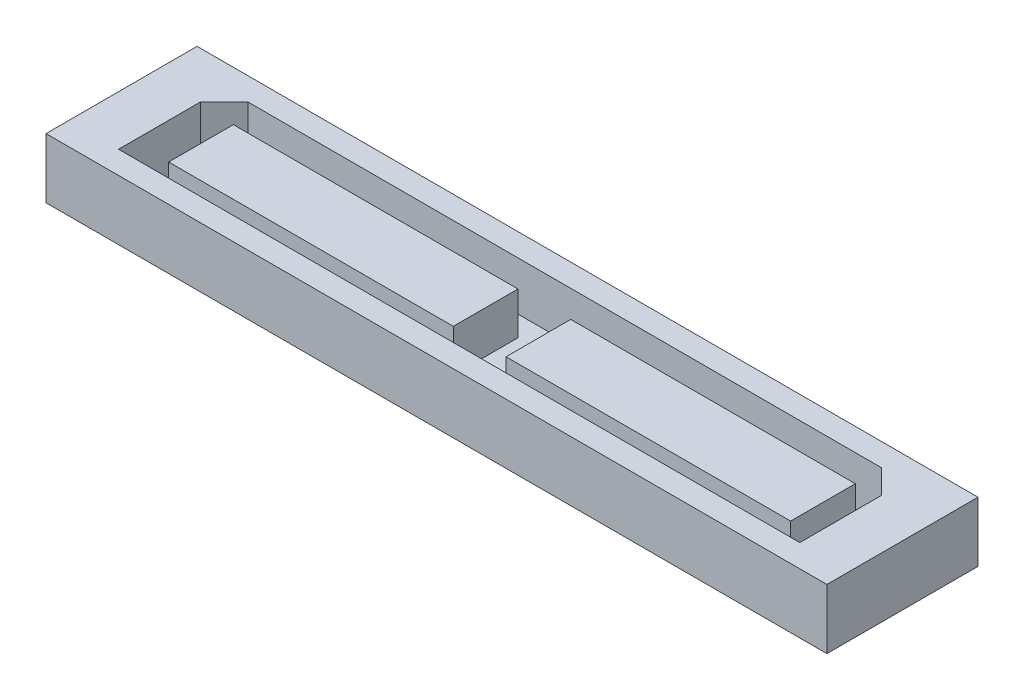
ISO-10303-21;
HEADER;
FILE_DESCRIPTION(('STEP AP214'),'2;1');
FILE_NAME('part.step','',(''),(''),'','','');
FILE_SCHEMA(('AUTOMOTIVE_DESIGN { 1 0 10303 214 1 1 1 1 }'));
ENDSEC;
DATA;
#1=APPLICATION_CONTEXT('core data for automotive mechanical design processes');
#2=APPLICATION_PROTOCOL_DEFINITION('international standard','automotive_design',2000,#1);
#3=PRODUCT_CONTEXT('',#1,'mechanical');
#4=PRODUCT('Part','Part','',(#3));
#5=PRODUCT_RELATED_PRODUCT_CATEGORY('part','',(#4));
#6=PRODUCT_DEFINITION_FORMATION('','',#4);
#7=PRODUCT_DEFINITION_CONTEXT('part definition',#1,'design');
#8=PRODUCT_DEFINITION('design','',#6,#7);
#9=PRODUCT_DEFINITION_SHAPE('','',#8);
#10=(LENGTH_UNIT() NAMED_UNIT(*) SI_UNIT(.MILLI.,.METRE.));
#11=(NAMED_UNIT(*) PLANE_ANGLE_UNIT() SI_UNIT($,.RADIAN.));
#12=(NAMED_UNIT(*) SI_UNIT($,.STERADIAN.) SOLID_ANGLE_UNIT());
#13=UNCERTAINTY_MEASURE_WITH_UNIT(LENGTH_MEASURE(1.E-05),#10,'distance_accuracy_value','');
#14=(GEOMETRIC_REPRESENTATION_CONTEXT(3) GLOBAL_UNCERTAINTY_ASSIGNED_CONTEXT((#13)) GLOBAL_UNIT_ASSIGNED_CONTEXT((#10,
#11,#12)) REPRESENTATION_CONTEXT('',''));
#15=CARTESIAN_POINT('',(0.,0.,0.));
#16=DIRECTION('',(0.,0.,1.));
#17=DIRECTION('',(1.,0.,0.));
#18=AXIS2_PLACEMENT_3D('',#15,#16,#17);
#19=CARTESIAN_POINT('',(-20.065365,0.761999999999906,-3.1115));
#20=DIRECTION('',(0.,-1.,0.));
#21=DIRECTION('',(0.,0.,-1.));
#22=AXIS2_PLACEMENT_3D('',#19,#20,#21);
#23=PLANE('',#22);
#24=DIRECTION('',(0.,0.,1.));
#25=VECTOR('',#24,1.);
#26=CARTESIAN_POINT('',(1.55321000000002,0.761999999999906,1.90499999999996));
#27=LINE('',#26,#25);
#28=CARTESIAN_POINT('',(1.55321000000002,0.761999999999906,-1.90500000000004));
#29=VERTEX_POINT('',#28);
#30=CARTESIAN_POINT('',(1.55321000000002,0.761999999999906,1.90499999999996));
#31=VERTEX_POINT('',#30);
#32=EDGE_CURVE('E191',#29,#31,#27,.T.);
#33=ORIENTED_EDGE('',*,*,#32,.F.);
#34=DIRECTION('',(-1.,0.,0.));
#35=VECTOR('',#34,1.);
#36=CARTESIAN_POINT('',(1.55321000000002,0.761999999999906,-1.90500000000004));
#37=LINE('',#36,#35);
#38=CARTESIAN_POINT('',(18.31721,0.761999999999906,-1.90500000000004));
#39=VERTEX_POINT('',#38);
#40=EDGE_CURVE('E200',#39,#29,#37,.T.);
#41=ORIENTED_EDGE('',*,*,#40,.F.);
#42=DIRECTION('',(0.,0.,-1.));
#43=VECTOR('',#42,1.);
#44=CARTESIAN_POINT('',(18.31721,0.761999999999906,-1.90500000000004));
#45=LINE('',#44,#43);
#46=CARTESIAN_POINT('',(18.31721,0.761999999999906,1.90499999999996));
#47=VERTEX_POINT('',#46);
#48=EDGE_CURVE('E197',#47,#39,#45,.T.);
#49=ORIENTED_EDGE('',*,*,#48,.F.);
#50=DIRECTION('',(1.,0.,0.));
#51=VECTOR('',#50,1.);
#52=CARTESIAN_POINT('',(18.31721,0.761999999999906,1.90499999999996));
#53=LINE('',#52,#51);
#54=EDGE_CURVE('E194',#31,#47,#53,.T.);
#55=ORIENTED_EDGE('',*,*,#54,.F.);
#56=EDGE_LOOP('',(#33,#41,#49,#55));
#57=FACE_BOUND('',#56,.T.);
#58=DIRECTION('',(-1.,0.,0.));
#59=VECTOR('',#58,1.);
#60=CARTESIAN_POINT('',(20.065365,0.761999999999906,-3.11150000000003));
#61=LINE('',#60,#59);
#62=CARTESIAN_POINT('',(18.668365,0.761999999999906,-3.11150000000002));
#63=VERTEX_POINT('',#62);
#64=CARTESIAN_POINT('',(-18.668365,0.761999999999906,-3.1115));
#65=VERTEX_POINT('',#64);
#66=EDGE_CURVE('E241',#63,#65,#61,.T.);
#67=ORIENTED_EDGE('',*,*,#66,.T.);
#68=DIRECTION('',(0.707106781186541,0.,-0.707106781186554));
#69=VECTOR('',#68,1.);
#70=CARTESIAN_POINT('',(-20.065365,0.761999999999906,-1.71449999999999));
#71=LINE('',#70,#69);
#72=CARTESIAN_POINT('',(-20.065365,0.761999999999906,-1.71449999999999));
#73=VERTEX_POINT('',#72);
#74=EDGE_CURVE('E291',#65,#73,#71,.F.);
#75=ORIENTED_EDGE('',*,*,#74,.T.);
#76=DIRECTION('',(0.,0.,1.));
#77=VECTOR('',#76,1.);
#78=CARTESIAN_POINT('',(-20.065365,0.761999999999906,-3.1115));
#79=LINE('',#78,#77);
#80=CARTESIAN_POINT('',(-20.065365,0.761999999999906,3.11149999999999));
#81=VERTEX_POINT('',#80);
#82=EDGE_CURVE('E234',#73,#81,#79,.T.);
#83=ORIENTED_EDGE('',*,*,#82,.T.);
#84=DIRECTION('',(1.,0.,0.));
#85=VECTOR('',#84,1.);
#86=CARTESIAN_POINT('',(-20.065365,0.761999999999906,3.11149999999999));
#87=LINE('',#86,#85);
#88=CARTESIAN_POINT('',(20.065365,0.761999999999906,3.11149999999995));
#89=VERTEX_POINT('',#88);
#90=EDGE_CURVE('E236',#81,#89,#87,.T.);
#91=ORIENTED_EDGE('',*,*,#90,.T.);
#92=DIRECTION('',(0.,0.,-1.));
#93=VECTOR('',#92,1.);
#94=CARTESIAN_POINT('',(20.065365,0.761999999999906,3.11149999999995));
#95=LINE('',#94,#93);
#96=CARTESIAN_POINT('',(20.065365,0.761999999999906,-1.71450000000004));
#97=VERTEX_POINT('',#96);
#98=EDGE_CURVE('E239',#89,#97,#95,.T.);
#99=ORIENTED_EDGE('',*,*,#98,.T.);
#100=DIRECTION('',(0.707106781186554,0.,0.707106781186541));
#101=VECTOR('',#100,1.);
#102=CARTESIAN_POINT('',(18.668365,0.761999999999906,-3.11150000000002));
#103=LINE('',#102,#101);
#104=EDGE_CURVE('E289',#97,#63,#103,.F.);
#105=ORIENTED_EDGE('',*,*,#104,.T.);
#106=EDGE_LOOP('',(#67,#75,#83,#91,#99,#105));
#107=FACE_BOUND('',#106,.T.);
#108=DIRECTION('',(1.,0.,0.));
#109=VECTOR('',#108,1.);
#110=CARTESIAN_POINT('',(-18.31721,0.761999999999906,1.90499999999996));
#111=LINE('',#110,#109);
#112=CARTESIAN_POINT('',(-18.31721,0.761999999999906,1.90499999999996));
#113=VERTEX_POINT('',#112);
#114=CARTESIAN_POINT('',(-1.55321000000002,0.761999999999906,1.90499999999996));
#115=VERTEX_POINT('',#114);
#116=EDGE_CURVE('E154',#113,#115,#111,.T.);
#117=ORIENTED_EDGE('',*,*,#116,.F.);
#118=DIRECTION('',(0.,0.,1.));
#119=VECTOR('',#118,1.);
#120=CARTESIAN_POINT('',(-18.31721,0.761999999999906,-1.90500000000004));
#121=LINE('',#120,#119);
#122=CARTESIAN_POINT('',(-18.31721,0.761999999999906,-1.90500000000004));
#123=VERTEX_POINT('',#122);
#124=EDGE_CURVE('E156',#123,#113,#121,.T.);
#125=ORIENTED_EDGE('',*,*,#124,.F.);
#126=DIRECTION('',(-1.,0.,0.));
#127=VECTOR('',#126,1.);
#128=CARTESIAN_POINT('',(-1.55321000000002,0.761999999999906,-1.90500000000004));
#129=LINE('',#128,#127);
#130=CARTESIAN_POINT('',(-1.55321000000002,0.761999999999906,-1.90500000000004));
#131=VERTEX_POINT('',#130);
#132=EDGE_CURVE('E175',#131,#123,#129,.T.);
#133=ORIENTED_EDGE('',*,*,#132,.F.);
#134=DIRECTION('',(0.,0.,-1.));
#135=VECTOR('',#134,1.);
#136=CARTESIAN_POINT('',(-1.55321000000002,0.761999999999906,1.90499999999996));
#137=LINE('',#136,#135);
#138=EDGE_CURVE('E159',#115,#131,#137,.T.);
#139=ORIENTED_EDGE('',*,*,#138,.F.);
#140=EDGE_LOOP('',(#117,#125,#133,#139));
#141=FACE_BOUND('',#140,.T.);
#142=ADVANCED_FACE('F30',(#57,#107,#141),#23,.F.);
#143=CARTESIAN_POINT('',(23.,0.101599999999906,4.45));
#144=DIRECTION('',(1.,0.,0.));
#145=DIRECTION('',(0.,0.,-1.));
#146=AXIS2_PLACEMENT_3D('',#143,#144,#145);
#147=PLANE('',#146);
#148=DIRECTION('',(0.,0.,-1.));
#149=VECTOR('',#148,1.);
#150=CARTESIAN_POINT('',(23.,3.63219999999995,4.45));
#151=LINE('',#150,#149);
#152=CARTESIAN_POINT('',(23.,3.63219999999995,4.45));
#153=VERTEX_POINT('',#152);
#154=CARTESIAN_POINT('',(23.,3.63219999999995,-4.45));
#155=VERTEX_POINT('',#154);
#156=EDGE_CURVE('E247',#153,#155,#151,.T.);
#157=ORIENTED_EDGE('',*,*,#156,.F.);
#158=DIRECTION('',(0.,1.,0.));
#159=VECTOR('',#158,1.);
#160=CARTESIAN_POINT('',(23.,0.101599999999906,4.45));
#161=LINE('',#160,#159);
#162=CARTESIAN_POINT('',(23.,0.101599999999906,4.45));
#163=VERTEX_POINT('',#162);
#164=EDGE_CURVE('E274',#163,#153,#161,.T.);
#165=ORIENTED_EDGE('',*,*,#164,.F.);
#166=DIRECTION('',(0.,0.,-1.));
#167=VECTOR('',#166,1.);
#168=CARTESIAN_POINT('',(23.,0.101599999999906,4.45));
#169=LINE('',#168,#167);
#170=CARTESIAN_POINT('',(23.,0.101599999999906,-4.45));
#171=VERTEX_POINT('',#170);
#172=EDGE_CURVE('E261',#163,#171,#169,.T.);
#173=ORIENTED_EDGE('',*,*,#172,.T.);
#174=DIRECTION('',(0.,1.,0.));
#175=VECTOR('',#174,1.);
#176=CARTESIAN_POINT('',(23.,0.101599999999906,-4.45));
#177=LINE('',#176,#175);
#178=EDGE_CURVE('E273',#171,#155,#177,.T.);
#179=ORIENTED_EDGE('',*,*,#178,.T.);
#180=EDGE_LOOP('',(#157,#165,#173,#179));
#181=FACE_BOUND('',#180,.T.);
#182=ADVANCED_FACE('F32',(#181),#147,.T.);
#183=CARTESIAN_POINT('',(-23.,0.101599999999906,4.45));
#184=DIRECTION('',(0.,0.,1.));
#185=DIRECTION('',(1.,0.,0.));
#186=AXIS2_PLACEMENT_3D('',#183,#184,#185);
#187=PLANE('',#186);
#188=DIRECTION('',(1.,0.,0.));
#189=VECTOR('',#188,1.);
#190=CARTESIAN_POINT('',(-23.,3.63219999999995,4.45));
#191=LINE('',#190,#189);
#192=CARTESIAN_POINT('',(-23.,3.63219999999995,4.45));
#193=VERTEX_POINT('',#192);
#194=EDGE_CURVE('E258',#193,#153,#191,.T.);
#195=ORIENTED_EDGE('',*,*,#194,.F.);
#196=DIRECTION('',(0.,1.,0.));
#197=VECTOR('',#196,1.);
#198=CARTESIAN_POINT('',(-23.,0.101599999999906,4.45));
#199=LINE('',#198,#197);
#200=CARTESIAN_POINT('',(-23.,0.101599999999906,4.45));
#201=VERTEX_POINT('',#200);
#202=EDGE_CURVE('E277',#201,#193,#199,.T.);
#203=ORIENTED_EDGE('',*,*,#202,.F.);
#204=DIRECTION('',(1.,0.,0.));
#205=VECTOR('',#204,1.);
#206=CARTESIAN_POINT('',(-23.,0.101599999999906,4.45));
#207=LINE('',#206,#205);
#208=EDGE_CURVE('E270',#201,#163,#207,.T.);
#209=ORIENTED_EDGE('',*,*,#208,.T.);
#210=ORIENTED_EDGE('',*,*,#164,.T.);
#211=EDGE_LOOP('',(#195,#203,#209,#210));
#212=FACE_BOUND('',#211,.T.);
#213=ADVANCED_FACE('F330',(#212),#187,.T.);
#214=CARTESIAN_POINT('',(-23.,0.101599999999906,-4.45));
#215=DIRECTION('',(-1.,0.,0.));
#216=DIRECTION('',(0.,0.,1.));
#217=AXIS2_PLACEMENT_3D('',#214,#215,#216);
#218=PLANE('',#217);
#219=DIRECTION('',(0.,0.,1.));
#220=VECTOR('',#219,1.);
#221=CARTESIAN_POINT('',(-23.,3.63219999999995,-4.45));
#222=LINE('',#221,#220);
#223=CARTESIAN_POINT('',(-23.,3.63219999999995,-4.45));
#224=VERTEX_POINT('',#223);
#225=EDGE_CURVE('E255',#224,#193,#222,.T.);
#226=ORIENTED_EDGE('',*,*,#225,.F.);
#227=DIRECTION('',(0.,1.,0.));
#228=VECTOR('',#227,1.);
#229=CARTESIAN_POINT('',(-23.,0.101599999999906,-4.45));
#230=LINE('',#229,#228);
#231=CARTESIAN_POINT('',(-23.,0.101599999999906,-4.45));
#232=VERTEX_POINT('',#231);
#233=EDGE_CURVE('E279',#232,#224,#230,.T.);
#234=ORIENTED_EDGE('',*,*,#233,.F.);
#235=DIRECTION('',(0.,0.,1.));
#236=VECTOR('',#235,1.);
#237=CARTESIAN_POINT('',(-23.,0.101599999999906,-4.45));
#238=LINE('',#237,#236);
#239=EDGE_CURVE('E267',#232,#201,#238,.T.);
#240=ORIENTED_EDGE('',*,*,#239,.T.);
#241=ORIENTED_EDGE('',*,*,#202,.T.);
#242=EDGE_LOOP('',(#226,#234,#240,#241));
#243=FACE_BOUND('',#242,.T.);
#244=ADVANCED_FACE('F354',(#243),#218,.T.);
#245=CARTESIAN_POINT('',(23.,0.101599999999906,-4.45));
#246=DIRECTION('',(0.,0.,-1.));
#247=DIRECTION('',(-1.,0.,0.));
#248=AXIS2_PLACEMENT_3D('',#245,#246,#247);
#249=PLANE('',#248);
#250=DIRECTION('',(-1.,0.,0.));
#251=VECTOR('',#250,1.);
#252=CARTESIAN_POINT('',(23.,3.63219999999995,-4.45));
#253=LINE('',#252,#251);
#254=EDGE_CURVE('E252',#155,#224,#253,.T.);
#255=ORIENTED_EDGE('',*,*,#254,.F.);
#256=ORIENTED_EDGE('',*,*,#178,.F.);
#257=DIRECTION('',(-1.,0.,0.));
#258=VECTOR('',#257,1.);
#259=CARTESIAN_POINT('',(23.,0.101599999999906,-4.45));
#260=LINE('',#259,#258);
#261=EDGE_CURVE('E264',#171,#232,#260,.T.);
#262=ORIENTED_EDGE('',*,*,#261,.T.);
#263=ORIENTED_EDGE('',*,*,#233,.T.);
#264=EDGE_LOOP('',(#255,#256,#262,#263));
#265=FACE_BOUND('',#264,.T.);
#266=ADVANCED_FACE('F350',(#265),#249,.T.);
#267=CARTESIAN_POINT('',(23.,0.101599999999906,-4.45));
#268=DIRECTION('',(0.,1.,0.));
#269=DIRECTION('',(0.,0.,1.));
#270=AXIS2_PLACEMENT_3D('',#267,#268,#269);
#271=PLANE('',#270);
#272=ORIENTED_EDGE('',*,*,#172,.F.);
#273=ORIENTED_EDGE('',*,*,#208,.F.);
#274=ORIENTED_EDGE('',*,*,#239,.F.);
#275=ORIENTED_EDGE('',*,*,#261,.F.);
#276=EDGE_LOOP('',(#272,#273,#274,#275));
#277=FACE_BOUND('',#276,.T.);
#278=ADVANCED_FACE('F347',(#277),#271,.F.);
#279=CARTESIAN_POINT('',(23.,3.63219999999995,-4.45));
#280=DIRECTION('',(0.,1.,0.));
#281=DIRECTION('',(0.,0.,1.));
#282=AXIS2_PLACEMENT_3D('',#279,#280,#281);
#283=PLANE('',#282);
#284=DIRECTION('',(0.,0.,1.));
#285=VECTOR('',#284,1.);
#286=CARTESIAN_POINT('',(-20.065365,3.63219999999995,-3.1115));
#287=LINE('',#286,#285);
#288=CARTESIAN_POINT('',(-20.065365,3.63219999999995,-1.71449999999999));
#289=VERTEX_POINT('',#288);
#290=CARTESIAN_POINT('',(-20.065365,3.63219999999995,3.11149999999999));
#291=VERTEX_POINT('',#290);
#292=EDGE_CURVE('E224',#289,#291,#287,.T.);
#293=ORIENTED_EDGE('',*,*,#292,.F.);
#294=DIRECTION('',(-0.707106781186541,0.,0.707106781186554));
#295=VECTOR('',#294,1.);
#296=CARTESIAN_POINT('',(-20.065365,3.63219999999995,-1.71449999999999));
#297=LINE('',#296,#295);
#298=CARTESIAN_POINT('',(-18.668365,3.63219999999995,-3.1115));
#299=VERTEX_POINT('',#298);
#300=EDGE_CURVE('E38',#289,#299,#297,.F.);
#301=ORIENTED_EDGE('',*,*,#300,.T.);
#302=DIRECTION('',(-1.,0.,0.));
#303=VECTOR('',#302,1.);
#304=CARTESIAN_POINT('',(20.065365,3.63219999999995,-3.11150000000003));
#305=LINE('',#304,#303);
#306=CARTESIAN_POINT('',(18.668365,3.63219999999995,-3.11150000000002));
#307=VERTEX_POINT('',#306);
#308=EDGE_CURVE('E231',#307,#299,#305,.T.);
#309=ORIENTED_EDGE('',*,*,#308,.F.);
#310=DIRECTION('',(-0.707106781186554,0.,-0.707106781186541));
#311=VECTOR('',#310,1.);
#312=CARTESIAN_POINT('',(18.668365,3.63219999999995,-3.11150000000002));
#313=LINE('',#312,#311);
#314=CARTESIAN_POINT('',(20.065365,3.63219999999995,-1.71450000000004));
#315=VERTEX_POINT('',#314);
#316=EDGE_CURVE('E11',#307,#315,#313,.F.);
#317=ORIENTED_EDGE('',*,*,#316,.T.);
#318=DIRECTION('',(0.,0.,-1.));
#319=VECTOR('',#318,1.);
#320=CARTESIAN_POINT('',(20.065365,3.63219999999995,3.11149999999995));
#321=LINE('',#320,#319);
#322=CARTESIAN_POINT('',(20.065365,3.63219999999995,3.11149999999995));
#323=VERTEX_POINT('',#322);
#324=EDGE_CURVE('E229',#323,#315,#321,.T.);
#325=ORIENTED_EDGE('',*,*,#324,.F.);
#326=DIRECTION('',(1.,0.,0.));
#327=VECTOR('',#326,1.);
#328=CARTESIAN_POINT('',(-20.065365,3.63219999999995,3.11149999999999));
#329=LINE('',#328,#327);
#330=EDGE_CURVE('E226',#291,#323,#329,.T.);
#331=ORIENTED_EDGE('',*,*,#330,.F.);
#332=EDGE_LOOP('',(#293,#301,#309,#317,#325,#331));
#333=FACE_BOUND('',#332,.T.);
#334=ORIENTED_EDGE('',*,*,#156,.T.);
#335=ORIENTED_EDGE('',*,*,#254,.T.);
#336=ORIENTED_EDGE('',*,*,#225,.T.);
#337=ORIENTED_EDGE('',*,*,#194,.T.);
#338=EDGE_LOOP('',(#334,#335,#336,#337));
#339=FACE_BOUND('',#338,.T.);
#340=ADVANCED_FACE('F294',(#333,#339),#283,.T.);
#341=CARTESIAN_POINT('',(-20.065365,0.761999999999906,-3.1115));
#342=DIRECTION('',(-1.,0.,0.));
#343=DIRECTION('',(0.,0.,1.));
#344=AXIS2_PLACEMENT_3D('',#341,#342,#343);
#345=PLANE('',#344);
#346=ORIENTED_EDGE('',*,*,#82,.F.);
#347=DIRECTION('',(0.,1.,0.));
#348=VECTOR('',#347,1.);
#349=CARTESIAN_POINT('',(-20.065365,3.63219999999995,-1.71449999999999));
#350=LINE('',#349,#348);
#351=EDGE_CURVE('E276',#73,#289,#350,.T.);
#352=ORIENTED_EDGE('',*,*,#351,.T.);
#353=ORIENTED_EDGE('',*,*,#292,.T.);
#354=DIRECTION('',(0.,1.,0.));
#355=VECTOR('',#354,1.);
#356=CARTESIAN_POINT('',(-20.065365,0.761999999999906,3.11149999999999));
#357=LINE('',#356,#355);
#358=EDGE_CURVE('E244',#81,#291,#357,.T.);
#359=ORIENTED_EDGE('',*,*,#358,.F.);
#360=EDGE_LOOP('',(#346,#352,#353,#359));
#361=FACE_BOUND('',#360,.T.);
#362=ADVANCED_FACE('F310',(#361),#345,.F.);
#363=CARTESIAN_POINT('',(20.065365,0.761999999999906,-3.11150000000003));
#364=DIRECTION('',(0.,0.,-1.));
#365=DIRECTION('',(-1.,0.,0.));
#366=AXIS2_PLACEMENT_3D('',#363,#364,#365);
#367=PLANE('',#366);
#368=ORIENTED_EDGE('',*,*,#308,.T.);
#369=DIRECTION('',(0.,-1.,0.));
#370=VECTOR('',#369,1.);
#371=CARTESIAN_POINT('',(-18.668365,0.761999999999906,-3.1115));
#372=LINE('',#371,#370);
#373=EDGE_CURVE('E287',#299,#65,#372,.T.);
#374=ORIENTED_EDGE('',*,*,#373,.T.);
#375=ORIENTED_EDGE('',*,*,#66,.F.);
#376=DIRECTION('',(0.,1.,0.));
#377=VECTOR('',#376,1.);
#378=CARTESIAN_POINT('',(18.668365,3.63219999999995,-3.11150000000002));
#379=LINE('',#378,#377);
#380=EDGE_CURVE('E284',#63,#307,#379,.T.);
#381=ORIENTED_EDGE('',*,*,#380,.T.);
#382=EDGE_LOOP('',(#368,#374,#375,#381));
#383=FACE_BOUND('',#382,.T.);
#384=ADVANCED_FACE('F301',(#383),#367,.F.);
#385=CARTESIAN_POINT('',(20.065365,0.761999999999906,3.11149999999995));
#386=DIRECTION('',(1.,0.,0.));
#387=DIRECTION('',(0.,0.,-1.));
#388=AXIS2_PLACEMENT_3D('',#385,#386,#387);
#389=PLANE('',#388);
#390=ORIENTED_EDGE('',*,*,#324,.T.);
#391=DIRECTION('',(0.,-1.,0.));
#392=VECTOR('',#391,1.);
#393=CARTESIAN_POINT('',(20.065365,0.761999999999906,-1.71450000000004));
#394=LINE('',#393,#392);
#395=EDGE_CURVE('E50',#315,#97,#394,.T.);
#396=ORIENTED_EDGE('',*,*,#395,.T.);
#397=ORIENTED_EDGE('',*,*,#98,.F.);
#398=DIRECTION('',(0.,1.,0.));
#399=VECTOR('',#398,1.);
#400=CARTESIAN_POINT('',(20.065365,0.761999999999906,3.11149999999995));
#401=LINE('',#400,#399);
#402=EDGE_CURVE('E245',#89,#323,#401,.T.);
#403=ORIENTED_EDGE('',*,*,#402,.T.);
#404=EDGE_LOOP('',(#390,#396,#397,#403));
#405=FACE_BOUND('',#404,.T.);
#406=ADVANCED_FACE('F338',(#405),#389,.F.);
#407=CARTESIAN_POINT('',(-20.065365,0.761999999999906,3.11149999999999));
#408=DIRECTION('',(0.,0.,1.));
#409=DIRECTION('',(1.,0.,0.));
#410=AXIS2_PLACEMENT_3D('',#407,#408,#409);
#411=PLANE('',#410);
#412=ORIENTED_EDGE('',*,*,#330,.T.);
#413=ORIENTED_EDGE('',*,*,#402,.F.);
#414=ORIENTED_EDGE('',*,*,#90,.F.);
#415=ORIENTED_EDGE('',*,*,#358,.T.);
#416=EDGE_LOOP('',(#412,#413,#414,#415));
#417=FACE_BOUND('',#416,.T.);
#418=ADVANCED_FACE('F313',(#417),#411,.F.);
#419=CARTESIAN_POINT('',(1.55321000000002,3.2511999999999,1.90499999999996));
#420=DIRECTION('',(1.,0.,0.));
#421=DIRECTION('',(0.,0.,-1.));
#422=AXIS2_PLACEMENT_3D('',#419,#420,#421);
#423=PLANE('',#422);
#424=ORIENTED_EDGE('',*,*,#32,.T.);
#425=DIRECTION('',(0.,-1.,0.));
#426=VECTOR('',#425,1.);
#427=CARTESIAN_POINT('',(1.55321000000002,3.2511999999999,1.90499999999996));
#428=LINE('',#427,#426);
#429=CARTESIAN_POINT('',(1.55321000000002,3.2511999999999,1.90499999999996));
#430=VERTEX_POINT('',#429);
#431=EDGE_CURVE('E221',#430,#31,#428,.T.);
#432=ORIENTED_EDGE('',*,*,#431,.F.);
#433=DIRECTION('',(0.,0.,1.));
#434=VECTOR('',#433,1.);
#435=CARTESIAN_POINT('',(1.55321000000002,3.2511999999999,1.90499999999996));
#436=LINE('',#435,#434);
#437=CARTESIAN_POINT('',(1.55321000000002,3.2511999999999,-1.90500000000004));
#438=VERTEX_POINT('',#437);
#439=EDGE_CURVE('E203',#438,#430,#436,.T.);
#440=ORIENTED_EDGE('',*,*,#439,.F.);
#441=DIRECTION('',(0.,-1.,0.));
#442=VECTOR('',#441,1.);
#443=CARTESIAN_POINT('',(1.55321000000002,3.2511999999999,-1.90500000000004));
#444=LINE('',#443,#442);
#445=EDGE_CURVE('E212',#438,#29,#444,.T.);
#446=ORIENTED_EDGE('',*,*,#445,.T.);
#447=EDGE_LOOP('',(#424,#432,#440,#446));
#448=FACE_BOUND('',#447,.T.);
#449=ADVANCED_FACE('F334',(#448),#423,.F.);
#450=CARTESIAN_POINT('',(18.31721,3.2511999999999,1.90499999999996));
#451=DIRECTION('',(0.,0.,-1.));
#452=DIRECTION('',(-1.,0.,0.));
#453=AXIS2_PLACEMENT_3D('',#450,#451,#452);
#454=PLANE('',#453);
#455=ORIENTED_EDGE('',*,*,#54,.T.);
#456=DIRECTION('',(0.,-1.,0.));
#457=VECTOR('',#456,1.);
#458=CARTESIAN_POINT('',(18.31721,3.2511999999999,1.90499999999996));
#459=LINE('',#458,#457);
#460=CARTESIAN_POINT('',(18.31721,3.2511999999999,1.90499999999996));
#461=VERTEX_POINT('',#460);
#462=EDGE_CURVE('E218',#461,#47,#459,.T.);
#463=ORIENTED_EDGE('',*,*,#462,.F.);
#464=DIRECTION('',(1.,0.,0.));
#465=VECTOR('',#464,1.);
#466=CARTESIAN_POINT('',(18.31721,3.2511999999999,1.90499999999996));
#467=LINE('',#466,#465);
#468=EDGE_CURVE('E206',#430,#461,#467,.T.);
#469=ORIENTED_EDGE('',*,*,#468,.F.);
#470=ORIENTED_EDGE('',*,*,#431,.T.);
#471=EDGE_LOOP('',(#455,#463,#469,#470));
#472=FACE_BOUND('',#471,.T.);
#473=ADVANCED_FACE('F403',(#472),#454,.F.);
#474=CARTESIAN_POINT('',(18.31721,3.2511999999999,-1.90500000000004));
#475=DIRECTION('',(-1.,0.,0.));
#476=DIRECTION('',(0.,0.,1.));
#477=AXIS2_PLACEMENT_3D('',#474,#475,#476);
#478=PLANE('',#477);
#479=ORIENTED_EDGE('',*,*,#48,.T.);
#480=DIRECTION('',(0.,-1.,0.));
#481=VECTOR('',#480,1.);
#482=CARTESIAN_POINT('',(18.31721,3.2511999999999,-1.90500000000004));
#483=LINE('',#482,#481);
#484=CARTESIAN_POINT('',(18.31721,3.2511999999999,-1.90500000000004));
#485=VERTEX_POINT('',#484);
#486=EDGE_CURVE('E215',#485,#39,#483,.T.);
#487=ORIENTED_EDGE('',*,*,#486,.F.);
#488=DIRECTION('',(0.,0.,-1.));
#489=VECTOR('',#488,1.);
#490=CARTESIAN_POINT('',(18.31721,3.2511999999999,-1.90500000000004));
#491=LINE('',#490,#489);
#492=EDGE_CURVE('E208',#461,#485,#491,.T.);
#493=ORIENTED_EDGE('',*,*,#492,.F.);
#494=ORIENTED_EDGE('',*,*,#462,.T.);
#495=EDGE_LOOP('',(#479,#487,#493,#494));
#496=FACE_BOUND('',#495,.T.);
#497=ADVANCED_FACE('F410',(#496),#478,.F.);
#498=CARTESIAN_POINT('',(1.55321000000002,3.2511999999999,-1.90500000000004));
#499=DIRECTION('',(0.,0.,1.));
#500=DIRECTION('',(1.,0.,0.));
#501=AXIS2_PLACEMENT_3D('',#498,#499,#500);
#502=PLANE('',#501);
#503=ORIENTED_EDGE('',*,*,#40,.T.);
#504=ORIENTED_EDGE('',*,*,#445,.F.);
#505=DIRECTION('',(-1.,0.,0.));
#506=VECTOR('',#505,1.);
#507=CARTESIAN_POINT('',(1.55321000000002,3.2511999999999,-1.90500000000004));
#508=LINE('',#507,#506);
#509=EDGE_CURVE('E210',#485,#438,#508,.T.);
#510=ORIENTED_EDGE('',*,*,#509,.F.);
#511=ORIENTED_EDGE('',*,*,#486,.T.);
#512=EDGE_LOOP('',(#503,#504,#510,#511));
#513=FACE_BOUND('',#512,.T.);
#514=ADVANCED_FACE('F417',(#513),#502,.F.);
#515=CARTESIAN_POINT('',(1.55321000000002,3.2511999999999,-1.90500000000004));
#516=DIRECTION('',(0.,-1.,0.));
#517=DIRECTION('',(0.,0.,-1.));
#518=AXIS2_PLACEMENT_3D('',#515,#516,#517);
#519=PLANE('',#518);
#520=ORIENTED_EDGE('',*,*,#439,.T.);
#521=ORIENTED_EDGE('',*,*,#468,.T.);
#522=ORIENTED_EDGE('',*,*,#492,.T.);
#523=ORIENTED_EDGE('',*,*,#509,.T.);
#524=EDGE_LOOP('',(#520,#521,#522,#523));
#525=FACE_BOUND('',#524,.T.);
#526=ADVANCED_FACE('F425',(#525),#519,.F.);
#527=CARTESIAN_POINT('',(-18.31721,3.2511999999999,1.90499999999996));
#528=DIRECTION('',(0.,0.,-1.));
#529=DIRECTION('',(-1.,0.,0.));
#530=AXIS2_PLACEMENT_3D('',#527,#528,#529);
#531=PLANE('',#530);
#532=ORIENTED_EDGE('',*,*,#116,.T.);
#533=DIRECTION('',(0.,-1.,0.));
#534=VECTOR('',#533,1.);
#535=CARTESIAN_POINT('',(-1.55321000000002,3.2511999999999,1.90499999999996));
#536=LINE('',#535,#534);
#537=CARTESIAN_POINT('',(-1.55321000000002,3.2511999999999,1.90499999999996));
#538=VERTEX_POINT('',#537);
#539=EDGE_CURVE('E189',#538,#115,#536,.T.);
#540=ORIENTED_EDGE('',*,*,#539,.F.);
#541=DIRECTION('',(1.,0.,0.));
#542=VECTOR('',#541,1.);
#543=CARTESIAN_POINT('',(-18.31721,3.2511999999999,1.90499999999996));
#544=LINE('',#543,#542);
#545=CARTESIAN_POINT('',(-18.31721,3.2511999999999,1.90499999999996));
#546=VERTEX_POINT('',#545);
#547=EDGE_CURVE('E174',#546,#538,#544,.T.);
#548=ORIENTED_EDGE('',*,*,#547,.F.);
#549=DIRECTION('',(0.,-1.,0.));
#550=VECTOR('',#549,1.);
#551=CARTESIAN_POINT('',(-18.31721,3.2511999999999,1.90499999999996));
#552=LINE('',#551,#550);
#553=EDGE_CURVE('E170',#546,#113,#552,.T.);
#554=ORIENTED_EDGE('',*,*,#553,.T.);
#555=EDGE_LOOP('',(#532,#540,#548,#554));
#556=FACE_BOUND('',#555,.T.);
#557=ADVANCED_FACE('F177',(#556),#531,.F.);
#558=CARTESIAN_POINT('',(-1.55321000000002,3.2511999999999,1.90499999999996));
#559=DIRECTION('',(-1.,0.,0.));
#560=DIRECTION('',(0.,0.,1.));
#561=AXIS2_PLACEMENT_3D('',#558,#559,#560);
#562=PLANE('',#561);
#563=ORIENTED_EDGE('',*,*,#138,.T.);
#564=DIRECTION('',(0.,-1.,0.));
#565=VECTOR('',#564,1.);
#566=CARTESIAN_POINT('',(-1.55321000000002,3.2511999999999,-1.90500000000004));
#567=LINE('',#566,#565);
#568=CARTESIAN_POINT('',(-1.55321000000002,3.2511999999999,-1.90500000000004));
#569=VERTEX_POINT('',#568);
#570=EDGE_CURVE('E181',#569,#131,#567,.T.);
#571=ORIENTED_EDGE('',*,*,#570,.F.);
#572=DIRECTION('',(0.,0.,-1.));
#573=VECTOR('',#572,1.);
#574=CARTESIAN_POINT('',(-1.55321000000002,3.2511999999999,1.90499999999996));
#575=LINE('',#574,#573);
#576=EDGE_CURVE('E534',#538,#569,#575,.T.);
#577=ORIENTED_EDGE('',*,*,#576,.F.);
#578=ORIENTED_EDGE('',*,*,#539,.T.);
#579=EDGE_LOOP('',(#563,#571,#577,#578));
#580=FACE_BOUND('',#579,.T.);
#581=ADVANCED_FACE('F440',(#580),#562,.F.);
#582=CARTESIAN_POINT('',(-1.55321000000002,3.2511999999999,-1.90500000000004));
#583=DIRECTION('',(0.,0.,1.));
#584=DIRECTION('',(1.,0.,0.));
#585=AXIS2_PLACEMENT_3D('',#582,#583,#584);
#586=PLANE('',#585);
#587=ORIENTED_EDGE('',*,*,#132,.T.);
#588=DIRECTION('',(0.,-1.,0.));
#589=VECTOR('',#588,1.);
#590=CARTESIAN_POINT('',(-18.31721,3.2511999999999,-1.90500000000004));
#591=LINE('',#590,#589);
#592=CARTESIAN_POINT('',(-18.31721,3.2511999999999,-1.90500000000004));
#593=VERTEX_POINT('',#592);
#594=EDGE_CURVE('E173',#593,#123,#591,.T.);
#595=ORIENTED_EDGE('',*,*,#594,.F.);
#596=DIRECTION('',(-1.,0.,0.));
#597=VECTOR('',#596,1.);
#598=CARTESIAN_POINT('',(-1.55321000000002,3.2511999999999,-1.90500000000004));
#599=LINE('',#598,#597);
#600=EDGE_CURVE('E183',#569,#593,#599,.T.);
#601=ORIENTED_EDGE('',*,*,#600,.F.);
#602=ORIENTED_EDGE('',*,*,#570,.T.);
#603=EDGE_LOOP('',(#587,#595,#601,#602));
#604=FACE_BOUND('',#603,.T.);
#605=ADVANCED_FACE('F447',(#604),#586,.F.);
#606=CARTESIAN_POINT('',(-18.31721,3.2511999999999,-1.90500000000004));
#607=DIRECTION('',(1.,0.,0.));
#608=DIRECTION('',(0.,0.,-1.));
#609=AXIS2_PLACEMENT_3D('',#606,#607,#608);
#610=PLANE('',#609);
#611=ORIENTED_EDGE('',*,*,#124,.T.);
#612=ORIENTED_EDGE('',*,*,#553,.F.);
#613=DIRECTION('',(0.,0.,1.));
#614=VECTOR('',#613,1.);
#615=CARTESIAN_POINT('',(-18.31721,3.2511999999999,-1.90500000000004));
#616=LINE('',#615,#614);
#617=EDGE_CURVE('E179',#593,#546,#616,.T.);
#618=ORIENTED_EDGE('',*,*,#617,.F.);
#619=ORIENTED_EDGE('',*,*,#594,.T.);
#620=EDGE_LOOP('',(#611,#612,#618,#619));
#621=FACE_BOUND('',#620,.T.);
#622=ADVANCED_FACE('F168',(#621),#610,.F.);
#623=CARTESIAN_POINT('',(-18.31721,3.2511999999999,1.90499999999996));
#624=DIRECTION('',(0.,-1.,0.));
#625=DIRECTION('',(0.,0.,-1.));
#626=AXIS2_PLACEMENT_3D('',#623,#624,#625);
#627=PLANE('',#626);
#628=ORIENTED_EDGE('',*,*,#547,.T.);
#629=ORIENTED_EDGE('',*,*,#576,.T.);
#630=ORIENTED_EDGE('',*,*,#600,.T.);
#631=ORIENTED_EDGE('',*,*,#617,.T.);
#632=EDGE_LOOP('',(#628,#629,#630,#631));
#633=FACE_BOUND('',#632,.T.);
#634=ADVANCED_FACE('F322',(#633),#627,.F.);
#635=CARTESIAN_POINT('',(-20.065365,0.761999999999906,-1.71449999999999));
#636=DIRECTION('',(0.707106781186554,0.,0.707106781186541));
#637=DIRECTION('',(0.707106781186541,0.,-0.707106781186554));
#638=AXIS2_PLACEMENT_3D('',#635,#636,#637);
#639=PLANE('',#638);
#640=ORIENTED_EDGE('',*,*,#74,.F.);
#641=ORIENTED_EDGE('',*,*,#373,.F.);
#642=ORIENTED_EDGE('',*,*,#300,.F.);
#643=ORIENTED_EDGE('',*,*,#351,.F.);
#644=EDGE_LOOP('',(#640,#641,#642,#643));
#645=FACE_BOUND('',#644,.T.);
#646=ADVANCED_FACE('F305',(#645),#639,.T.);
#647=CARTESIAN_POINT('',(18.668365,0.761999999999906,-3.11150000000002));
#648=DIRECTION('',(-0.707106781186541,0.,0.707106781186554));
#649=DIRECTION('',(0.707106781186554,0.,0.707106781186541));
#650=AXIS2_PLACEMENT_3D('',#647,#648,#649);
#651=PLANE('',#650);
#652=ORIENTED_EDGE('',*,*,#104,.F.);
#653=ORIENTED_EDGE('',*,*,#395,.F.);
#654=ORIENTED_EDGE('',*,*,#316,.F.);
#655=ORIENTED_EDGE('',*,*,#380,.F.);
#656=EDGE_LOOP('',(#652,#653,#654,#655));
#657=FACE_BOUND('',#656,.T.);
#658=ADVANCED_FACE('F316',(#657),#651,.T.);
#659=CLOSED_SHELL('',(#142,#182,#213,#244,#266,#278,#340,#362,#384,#406,#418,#449,#473,#497,
#514,#526,#557,#581,#605,#622,#634,#646,#658));
#660=MANIFOLD_SOLID_BREP('B2',#659);
#661=ADVANCED_BREP_SHAPE_REPRESENTATION('',(#18,#660),#14);
#662=SHAPE_DEFINITION_REPRESENTATION(#9,#661);
ENDSEC;
END-ISO-10303-21;
